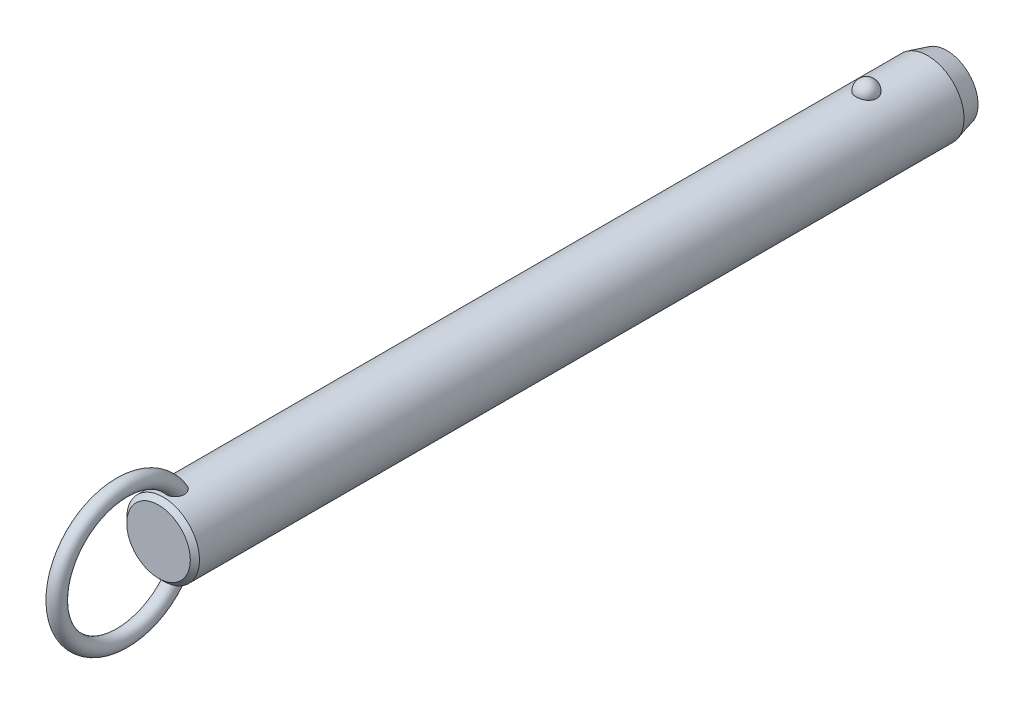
ISO-10303-21;
HEADER;
FILE_DESCRIPTION(('STEP AP214'),'2;1');
FILE_NAME('part.step','',(''),(''),'','','');
FILE_SCHEMA(('AUTOMOTIVE_DESIGN { 1 0 10303 214 1 1 1 1 }'));
ENDSEC;
DATA;
#1=APPLICATION_CONTEXT('core data for automotive mechanical design processes');
#2=APPLICATION_PROTOCOL_DEFINITION('international standard','automotive_design',2000,#1);
#3=PRODUCT_CONTEXT('',#1,'mechanical');
#4=PRODUCT('Part','Part','',(#3));
#5=PRODUCT_RELATED_PRODUCT_CATEGORY('part','',(#4));
#6=PRODUCT_DEFINITION_FORMATION('','',#4);
#7=PRODUCT_DEFINITION_CONTEXT('part definition',#1,'design');
#8=PRODUCT_DEFINITION('design','',#6,#7);
#9=PRODUCT_DEFINITION_SHAPE('','',#8);
#10=(LENGTH_UNIT() NAMED_UNIT(*) SI_UNIT(.MILLI.,.METRE.));
#11=(NAMED_UNIT(*) PLANE_ANGLE_UNIT() SI_UNIT($,.RADIAN.));
#12=(NAMED_UNIT(*) SI_UNIT($,.STERADIAN.) SOLID_ANGLE_UNIT());
#13=UNCERTAINTY_MEASURE_WITH_UNIT(LENGTH_MEASURE(1.E-05),#10,'distance_accuracy_value','');
#14=(GEOMETRIC_REPRESENTATION_CONTEXT(3) GLOBAL_UNCERTAINTY_ASSIGNED_CONTEXT((#13)) GLOBAL_UNIT_ASSIGNED_CONTEXT((#10,
#11,#12)) REPRESENTATION_CONTEXT('',''));
#15=CARTESIAN_POINT('',(0.,0.,0.));
#16=DIRECTION('',(0.,0.,1.));
#17=DIRECTION('',(1.,0.,0.));
#18=AXIS2_PLACEMENT_3D('',#15,#16,#17);
#19=CARTESIAN_POINT('',(0.,0.,172.7));
#20=DIRECTION('',(0.,0.,-1.));
#21=DIRECTION('',(-1.,0.,0.));
#22=AXIS2_PLACEMENT_3D('',#19,#20,#21);
#23=CYLINDRICAL_SURFACE('',#22,9.5);
#24=CARTESIAN_POINT('',(2.67259918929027,9.11631578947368,-2.70000000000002));
#25=CARTESIAN_POINT('',(2.6725968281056,9.11631786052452,-2.54909854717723));
#26=CARTESIAN_POINT('',(2.66030567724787,9.11994722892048,-2.39816735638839));
#27=CARTESIAN_POINT('',(2.6114347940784,9.13405924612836,-2.10058568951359));
#28=CARTESIAN_POINT('',(2.57484658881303,9.14454428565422,-1.95393672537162));
#29=CARTESIAN_POINT('',(2.47830875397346,9.17117631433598,-1.66916069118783));
#30=CARTESIAN_POINT('',(2.41836936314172,9.18732082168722,-1.53102991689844));
#31=CARTESIAN_POINT('',(2.27661331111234,9.22346780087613,-1.26705393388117));
#32=CARTESIAN_POINT('',(2.19479699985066,9.24347021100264,-1.14120852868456));
#33=CARTESIAN_POINT('',(2.01085282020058,9.28522401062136,-0.904632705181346));
#34=CARTESIAN_POINT('',(1.90862396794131,9.30698376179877,-0.793982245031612));
#35=CARTESIAN_POINT('',(1.6867437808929,9.34973971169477,-0.591607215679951));
#36=CARTESIAN_POINT('',(1.56709244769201,9.37073591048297,-0.499882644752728));
#37=CARTESIAN_POINT('',(1.31393976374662,9.40956370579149,-0.338167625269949));
#38=CARTESIAN_POINT('',(1.18048026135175,9.42740444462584,-0.268113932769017));
#39=CARTESIAN_POINT('',(0.903154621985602,9.45799906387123,-0.151390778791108));
#40=CARTESIAN_POINT('',(0.759289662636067,9.47075351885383,-0.104718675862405));
#41=CARTESIAN_POINT('',(0.468074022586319,9.48956256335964,-0.0367633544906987));
#42=CARTESIAN_POINT('',(0.320836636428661,9.49573643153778,-0.015027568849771));
#43=CARTESIAN_POINT('',(0.0246714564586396,9.50112183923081,0.00396199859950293));
#44=CARTESIAN_POINT('',(-0.124256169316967,9.50033406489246,0.00121819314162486));
#45=CARTESIAN_POINT('',(-0.417264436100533,9.4919475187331,-0.0284441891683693));
#46=CARTESIAN_POINT('',(-0.561384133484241,9.48444885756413,-0.0550074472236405));
#47=CARTESIAN_POINT('',(-0.842986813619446,9.46357853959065,-0.131064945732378));
#48=CARTESIAN_POINT('',(-0.98046968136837,9.450206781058,-0.180559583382));
#49=CARTESIAN_POINT('',(-1.24585005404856,9.41890822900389,-0.301476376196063));
#50=CARTESIAN_POINT('',(-1.37368611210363,9.40095498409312,-0.373026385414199));
#51=CARTESIAN_POINT('',(-1.61552738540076,9.3624296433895,-0.536025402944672));
#52=CARTESIAN_POINT('',(-1.72953116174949,9.34185727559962,-0.627476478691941));
#53=CARTESIAN_POINT('',(-1.9429225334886,9.29984568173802,-0.829844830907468));
#54=CARTESIAN_POINT('',(-2.04198021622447,9.27839736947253,-0.941108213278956));
#55=CARTESIAN_POINT('',(-2.2202646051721,9.23735994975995,-1.17883414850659));
#56=CARTESIAN_POINT('',(-2.29948985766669,9.21777097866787,-1.30529781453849));
#57=CARTESIAN_POINT('',(-2.43697287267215,9.18238994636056,-1.57158566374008));
#58=CARTESIAN_POINT('',(-2.49497068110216,9.16664569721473,-1.71155057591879));
#59=CARTESIAN_POINT('',(-2.5872073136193,9.14104303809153,-1.99961197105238));
#60=CARTESIAN_POINT('',(-2.62144683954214,9.13118445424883,-2.1477082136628));
#61=CARTESIAN_POINT('',(-2.66521466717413,9.11850622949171,-2.44715424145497));
#62=CARTESIAN_POINT('',(-2.67484831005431,9.11565658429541,-2.59848735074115));
#63=CARTESIAN_POINT('',(-2.66946735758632,9.11723375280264,-2.90067317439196));
#64=CARTESIAN_POINT('',(-2.65445345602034,9.12166036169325,-3.05152590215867));
#65=CARTESIAN_POINT('',(-2.6002971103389,9.13724422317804,-3.34766110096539));
#66=CARTESIAN_POINT('',(-2.56127978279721,9.14836656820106,-3.49296833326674));
#67=CARTESIAN_POINT('',(-2.46018844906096,9.17606676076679,-3.77477535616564));
#68=CARTESIAN_POINT('',(-2.39811349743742,9.19264483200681,-3.91127478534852));
#69=CARTESIAN_POINT('',(-2.25202303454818,9.22952198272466,-4.17244273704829));
#70=CARTESIAN_POINT('',(-2.16788714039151,9.24984129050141,-4.29704106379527));
#71=CARTESIAN_POINT('',(-1.9799408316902,9.29188255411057,-4.53013066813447));
#72=CARTESIAN_POINT('',(-1.87612963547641,9.31360456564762,-4.63862130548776));
#73=CARTESIAN_POINT('',(-1.65105429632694,9.35612959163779,-4.83690299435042));
#74=CARTESIAN_POINT('',(-1.52972405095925,9.37692871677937,-4.9266199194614));
#75=CARTESIAN_POINT('',(-1.27318250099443,9.41518970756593,-5.08429106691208));
#76=CARTESIAN_POINT('',(-1.13797219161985,9.432651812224,-5.15224684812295));
#77=CARTESIAN_POINT('',(-0.859280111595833,9.46208255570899,-5.26371827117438));
#78=CARTESIAN_POINT('',(-0.715925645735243,9.47411833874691,-5.30753421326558));
#79=CARTESIAN_POINT('',(-0.423550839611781,9.4916822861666,-5.37076321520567));
#80=CARTESIAN_POINT('',(-0.274531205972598,9.49721125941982,-5.39017930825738));
#81=CARTESIAN_POINT('',(0.0218446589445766,9.50110860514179,-5.40390587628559));
#82=CARTESIAN_POINT('',(0.169177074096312,9.49961381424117,-5.39869609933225));
#83=CARTESIAN_POINT('',(0.460808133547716,9.48993906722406,-5.36441955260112));
#84=CARTESIAN_POINT('',(0.605106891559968,9.48175936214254,-5.33535367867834));
#85=CARTESIAN_POINT('',(0.886027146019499,9.4596376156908,-5.25435587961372));
#86=CARTESIAN_POINT('',(1.02267710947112,9.44571881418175,-5.20251612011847));
#87=CARTESIAN_POINT('',(1.28523827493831,9.41358993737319,-5.07741549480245));
#88=CARTESIAN_POINT('',(1.41114877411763,9.39537958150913,-5.00415322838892));
#89=CARTESIAN_POINT('',(1.65085227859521,9.3562644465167,-4.83684599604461));
#90=CARTESIAN_POINT('',(1.76442346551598,9.33532178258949,-4.74249218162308));
#91=CARTESIAN_POINT('',(1.97425672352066,9.29321198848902,-4.53620389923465));
#92=CARTESIAN_POINT('',(2.07051582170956,9.27204482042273,-4.42426641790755));
#93=CARTESIAN_POINT('',(2.24490086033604,9.23139221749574,-4.18363183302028));
#94=CARTESIAN_POINT('',(2.32267019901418,9.21194380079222,-4.05466990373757));
#95=CARTESIAN_POINT('',(2.45584092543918,9.1773419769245,-3.78517836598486));
#96=CARTESIAN_POINT('',(2.51124979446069,9.16218713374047,-3.644652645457));
#97=CARTESIAN_POINT('',(2.59380876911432,9.13913522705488,-3.37104301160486));
#98=CARTESIAN_POINT('',(2.62330266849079,9.13064624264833,-3.23871053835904));
#99=CARTESIAN_POINT('',(2.66269870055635,9.11923566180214,-2.97092664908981));
#100=CARTESIAN_POINT('',(2.67260130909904,9.11631393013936,-2.83547530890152));
#101=CARTESIAN_POINT('',(2.67259918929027,9.11631578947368,-2.70000000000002));
#102=B_SPLINE_CURVE_WITH_KNOTS('',3,(#24,#25,#26,#27,#28,#29,#30,#31,#32,#33,#34,#35,#36,#37,
#38,#39,#40,#41,#42,#43,#44,#45,#46,#47,#48,#49,#50,#51,#52,#53,#54,#55,#56,#57,#58,#59,#60,#61,
#62,#63,#64,#65,#66,#67,#68,#69,#70,#71,#72,#73,#74,#75,#76,#77,#78,#79,#80,#81,#82,#83,#84,#85,
#86,#87,#88,#89,#90,#91,#92,#93,#94,#95,#96,#97,#98,#99,#100,#101),.UNSPECIFIED.,.T.,.F.,(4,2,2,
2,2,2,2,2,2,2,2,2,2,2,2,2,2,2,2,2,2,2,2,2,2,2,2,2,2,2,2,2,2,2,2,2,2,2,4),(0.,0.452217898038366,
0.904593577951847,1.35677112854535,1.80894144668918,2.26340676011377,2.71787203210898,
3.17099820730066,3.62407318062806,4.0687883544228,4.51345969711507,4.95160616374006,
5.38976021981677,5.83050358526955,6.27129275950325,6.72071308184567,7.17016633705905,
7.62495278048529,8.07972578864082,8.53254856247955,8.98535859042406,9.43582813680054,
9.88631615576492,10.3393155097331,10.7923328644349,11.2471065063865,11.7018475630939,
12.1507959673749,12.5996885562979,13.0398725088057,13.4800399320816,13.9184421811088,
14.3568730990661,14.802202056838,15.2476074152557,15.7010097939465,16.1542603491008,
16.5602594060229,16.9662486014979),.UNSPECIFIED.);
#103=CARTESIAN_POINT('',(2.67259918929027,9.11631578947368,-2.70000000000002));
#104=VERTEX_POINT('',#103);
#105=EDGE_CURVE('E41',#104,#104,#102,.T.);
#106=ORIENTED_EDGE('',*,*,#105,.T.);
#107=EDGE_LOOP('',(#106));
#108=FACE_BOUND('',#107,.T.);
#109=CARTESIAN_POINT('',(0.,0.,181.02));
#110=DIRECTION('',(0.,0.,1.));
#111=DIRECTION('',(1.,0.,0.));
#112=AXIS2_PLACEMENT_3D('',#109,#110,#111);
#113=CIRCLE('',#112,9.5);
#114=CARTESIAN_POINT('',(9.5,0.,181.02));
#115=VERTEX_POINT('',#114);
#116=EDGE_CURVE('E10',#115,#115,#113,.F.);
#117=ORIENTED_EDGE('',*,*,#116,.T.);
#118=EDGE_LOOP('',(#117));
#119=FACE_BOUND('',#118,.T.);
#120=CARTESIAN_POINT('',(-0.697062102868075,-9.47439269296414,175.367808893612));
#121=CARTESIAN_POINT('',(-0.799579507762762,-9.46685146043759,175.407482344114));
#122=CARTESIAN_POINT('',(-0.89857563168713,-9.45788043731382,175.4559309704));
#123=CARTESIAN_POINT('',(-1.08670047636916,-9.43811593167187,175.568868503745));
#124=CARTESIAN_POINT('',(-1.17583204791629,-9.42732297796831,175.633352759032));
#125=CARTESIAN_POINT('',(-1.34179806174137,-9.40513672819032,175.776209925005));
#126=CARTESIAN_POINT('',(-1.41865133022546,-9.39374438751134,175.854561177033));
#127=CARTESIAN_POINT('',(-1.5586004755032,-9.37154196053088,176.022752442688));
#128=CARTESIAN_POINT('',(-1.62169476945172,-9.3607319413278,176.11259377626));
#129=CARTESIAN_POINT('',(-1.73527695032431,-9.34035749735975,176.304500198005));
#130=CARTESIAN_POINT('',(-1.78522266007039,-9.33085270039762,176.406891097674));
#131=CARTESIAN_POINT('',(-1.86924997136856,-9.3143834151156,176.618148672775));
#132=CARTESIAN_POINT('',(-1.90332570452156,-9.30741986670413,176.727017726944));
#133=CARTESIAN_POINT('',(-1.95893603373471,-9.29588482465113,176.960473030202));
#134=CARTESIAN_POINT('',(-1.97872420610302,-9.29165182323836,177.085489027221));
#135=CARTESIAN_POINT('',(-2.00062129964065,-9.28695978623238,177.337080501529));
#136=CARTESIAN_POINT('',(-2.00272284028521,-9.28650232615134,177.463656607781));
#137=CARTESIAN_POINT('',(-1.98958876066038,-9.28932750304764,177.736815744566));
#138=CARTESIAN_POINT('',(-1.97143366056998,-9.2932400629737,177.883251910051));
#139=CARTESIAN_POINT('',(-1.91479925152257,-9.30507151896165,178.172062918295));
#140=CARTESIAN_POINT('',(-1.87629122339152,-9.31299607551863,178.314431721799));
#141=CARTESIAN_POINT('',(-1.7722568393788,-9.33340232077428,178.615172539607));
#142=CARTESIAN_POINT('',(-1.70334898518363,-9.34641636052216,178.772369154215));
#143=CARTESIAN_POINT('',(-1.58111062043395,-9.36759153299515,178.997517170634));
#144=CARTESIAN_POINT('',(-1.53721459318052,-9.3749261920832,179.070796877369));
#145=CARTESIAN_POINT('',(-1.44302631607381,-9.38988566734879,179.21307405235));
#146=CARTESIAN_POINT('',(-1.39273721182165,-9.39751033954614,179.282073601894));
#147=CARTESIAN_POINT('',(-1.26775962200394,-9.41530678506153,179.436983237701));
#148=CARTESIAN_POINT('',(-1.19052326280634,-9.42548108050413,179.520871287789));
#149=CARTESIAN_POINT('',(-1.0242024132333,-9.44499825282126,179.676008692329));
#150=CARTESIAN_POINT('',(-0.935139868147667,-9.45434261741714,179.747280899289));
#151=CARTESIAN_POINT('',(-0.766610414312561,-9.46930670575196,179.858695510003));
#152=CARTESIAN_POINT('',(-0.689439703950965,-9.47529223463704,179.902235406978));
#153=CARTESIAN_POINT('',(-0.52894200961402,-9.48560294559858,179.97631336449));
#154=CARTESIAN_POINT('',(-0.445620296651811,-9.48992953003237,180.006862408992));
#155=CARTESIAN_POINT('',(-0.273901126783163,-9.49644161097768,180.052579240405));
#156=CARTESIAN_POINT('',(-0.18546574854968,-9.49860811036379,180.06761059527));
#157=CARTESIAN_POINT('',(-0.00734541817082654,-9.5004135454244,180.080149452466));
#158=CARTESIAN_POINT('',(0.082338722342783,-9.50005405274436,180.077667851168));
#159=CARTESIAN_POINT('',(0.247679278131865,-9.49708301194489,180.056995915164));
#160=CARTESIAN_POINT('',(0.323620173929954,-9.49477609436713,180.040930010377));
#161=CARTESIAN_POINT('',(0.471981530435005,-9.48855917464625,179.997172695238));
#162=CARTESIAN_POINT('',(0.544400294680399,-9.48464840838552,179.969475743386));
#163=CARTESIAN_POINT('',(0.708947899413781,-9.47398336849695,179.89280266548));
#164=CARTESIAN_POINT('',(0.799149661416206,-9.46671310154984,179.839774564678));
#165=CARTESIAN_POINT('',(0.969783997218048,-9.45076225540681,179.719973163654));
#166=CARTESIAN_POINT('',(1.05019415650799,-9.44207854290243,179.653169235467));
#167=CARTESIAN_POINT('',(1.23092343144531,-9.42051459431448,179.480759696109));
#168=CARTESIAN_POINT('',(1.32652499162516,-9.40733378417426,179.37026193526));
#169=CARTESIAN_POINT('',(1.49893121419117,-9.38140745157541,179.135561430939));
#170=CARTESIAN_POINT('',(1.57571616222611,-9.36866239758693,179.011344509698));
#171=CARTESIAN_POINT('',(1.71285426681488,-9.34457644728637,178.749389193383));
#172=CARTESIAN_POINT('',(1.77266365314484,-9.33328726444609,178.61136233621));
#173=CARTESIAN_POINT('',(1.87239208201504,-9.31379209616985,178.328051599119));
#174=CARTESIAN_POINT('',(1.91230158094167,-9.30558759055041,178.182764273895));
#175=CARTESIAN_POINT('',(1.97604189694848,-9.29228394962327,177.862028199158));
#176=CARTESIAN_POINT('',(1.9958743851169,-9.28797202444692,177.685724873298));
#177=CARTESIAN_POINT('',(2.00295708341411,-9.28645519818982,177.332414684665));
#178=CARTESIAN_POINT('',(1.99025930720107,-9.28923895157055,177.155409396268));
#179=CARTESIAN_POINT('',(1.93735479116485,-9.30038134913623,176.856338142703));
#180=CARTESIAN_POINT('',(1.90576827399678,-9.30697680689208,176.732667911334));
#181=CARTESIAN_POINT('',(1.82287484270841,-9.32356855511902,176.492329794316));
#182=CARTESIAN_POINT('',(1.77158213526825,-9.33356239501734,176.375656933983));
#183=CARTESIAN_POINT('',(1.64885744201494,-9.35602275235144,176.152706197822));
#184=CARTESIAN_POINT('',(1.57730995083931,-9.36850332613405,176.046492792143));
#185=CARTESIAN_POINT('',(1.41543264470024,-9.39431873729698,175.849553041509));
#186=CARTESIAN_POINT('',(1.32510883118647,-9.40765330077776,175.758821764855));
#187=CARTESIAN_POINT('',(1.13846223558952,-9.43195720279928,175.605033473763));
#188=CARTESIAN_POINT('',(1.04369890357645,-9.44302894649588,175.540094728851));
#189=CARTESIAN_POINT('',(0.843965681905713,-9.46296805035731,175.428038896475));
#190=CARTESIAN_POINT('',(0.739000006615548,-9.47183631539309,175.380914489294));
#191=CARTESIAN_POINT('',(0.528175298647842,-9.48586140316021,175.308117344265));
#192=CARTESIAN_POINT('',(0.422686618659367,-9.49119633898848,175.28140249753));
#193=CARTESIAN_POINT('',(0.208590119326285,-9.49831365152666,175.246013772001));
#194=CARTESIAN_POINT('',(0.0999817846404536,-9.500095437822,175.237342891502));
#195=CARTESIAN_POINT('',(-0.126104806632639,-9.49988861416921,175.238350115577));
#196=CARTESIAN_POINT('',(-0.243578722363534,-9.49757821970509,175.249594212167));
#197=CARTESIAN_POINT('',(-0.474390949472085,-9.48885165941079,175.293167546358));
#198=CARTESIAN_POINT('',(-0.587729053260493,-9.48243528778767,175.325497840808));
#199=CARTESIAN_POINT('',(-0.697062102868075,-9.47439269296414,175.367808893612));
#200=B_SPLINE_CURVE_WITH_KNOTS('',3,(#120,#121,#122,#123,#124,#125,#126,#127,#128,#129,#130,
#131,#132,#133,#134,#135,#136,#137,#138,#139,#140,#141,#142,#143,#144,#145,#146,#147,#148,#149,
#150,#151,#152,#153,#154,#155,#156,#157,#158,#159,#160,#161,#162,#163,#164,#165,#166,#167,#168,
#169,#170,#171,#172,#173,#174,#175,#176,#177,#178,#179,#180,#181,#182,#183,#184,#185,#186,#187,
#188,#189,#190,#191,#192,#193,#194,#195,#196,#197,#198,#199),.UNSPECIFIED.,.T.,.F.,(4,2,2,2,2,2,
2,2,2,2,2,2,2,2,2,2,2,2,2,2,2,2,2,2,2,2,2,2,2,2,2,2,2,2,2,2,2,2,2,4),(0.,0.330119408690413,
0.6601431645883,0.98965593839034,1.31920659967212,1.66074728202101,2.00241415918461,
2.3808869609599,2.75951768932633,3.20065679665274,3.64242004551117,4.15620996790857,
4.4131416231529,4.66994734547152,5.01228664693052,5.35399933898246,5.61943037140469,
5.88463652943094,6.15215502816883,6.41950709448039,6.65144391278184,6.88349136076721,
7.19641200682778,7.51003602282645,7.94779711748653,8.3860149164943,8.83699707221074,
9.28819530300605,9.81778662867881,10.34653170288,10.7284172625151,11.1100280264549,
11.4938603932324,11.8775702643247,12.2220189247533,12.5663259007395,12.8915939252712,
13.2169159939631,13.5689650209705,13.9210316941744),.UNSPECIFIED.);
#201=CARTESIAN_POINT('',(-0.697062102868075,-9.47439269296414,175.367808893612));
#202=VERTEX_POINT('',#201);
#203=EDGE_CURVE('E59',#202,#202,#200,.T.);
#204=ORIENTED_EDGE('',*,*,#203,.T.);
#205=EDGE_LOOP('',(#204));
#206=FACE_BOUND('',#205,.T.);
#207=CARTESIAN_POINT('',(-0.697062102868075,9.47439269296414,175.367808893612));
#208=CARTESIAN_POINT('',(-0.597792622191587,9.48169483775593,175.32939564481));
#209=CARTESIAN_POINT('',(-0.495106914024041,9.48766580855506,175.299168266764));
#210=CARTESIAN_POINT('',(-0.285876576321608,9.49627648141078,175.256032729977));
#211=CARTESIAN_POINT('',(-0.179324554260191,9.49890941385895,175.243159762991));
#212=CARTESIAN_POINT('',(0.0344157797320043,9.50053798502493,175.235166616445));
#213=CARTESIAN_POINT('',(0.14160360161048,9.49953613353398,175.240034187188));
#214=CARTESIAN_POINT('',(0.353563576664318,9.49401038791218,175.267365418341));
#215=CARTESIAN_POINT('',(0.458336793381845,9.48948807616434,175.28982117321));
#216=CARTESIAN_POINT('',(0.662493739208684,9.4774236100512,175.351671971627));
#217=CARTESIAN_POINT('',(0.761881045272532,9.46988348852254,175.391055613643));
#218=CARTESIAN_POINT('',(0.952608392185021,9.45260382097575,175.485634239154));
#219=CARTESIAN_POINT('',(1.04394806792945,9.44286417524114,175.540829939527));
#220=CARTESIAN_POINT('',(1.21712767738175,9.42211760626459,175.666066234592));
#221=CARTESIAN_POINT('',(1.29885671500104,9.41109835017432,175.736257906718));
#222=CARTESIAN_POINT('',(1.44978975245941,9.38903310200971,175.888980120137));
#223=CARTESIAN_POINT('',(1.51899278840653,9.37798710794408,175.971511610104));
#224=CARTESIAN_POINT('',(1.64602857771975,9.35654375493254,176.149776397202));
#225=CARTESIAN_POINT('',(1.70333052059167,9.34618688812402,176.245891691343));
#226=CARTESIAN_POINT('',(1.80259341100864,9.32755128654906,176.445897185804));
#227=CARTESIAN_POINT('',(1.84454942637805,9.31927322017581,176.549789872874));
#228=CARTESIAN_POINT('',(1.91637039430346,9.30478365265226,176.772213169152));
#229=CARTESIAN_POINT('',(1.944805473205,9.29882552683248,176.891219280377));
#230=CARTESIAN_POINT('',(1.98449865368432,9.29043398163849,177.132143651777));
#231=CARTESIAN_POINT('',(1.99574908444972,9.28800213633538,177.254063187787));
#232=CARTESIAN_POINT('',(2.00275141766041,9.28649645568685,177.516932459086));
#233=CARTESIAN_POINT('',(1.99588238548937,9.28799035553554,177.657952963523));
#234=CARTESIAN_POINT('',(1.96270559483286,9.29505517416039,177.937621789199));
#235=CARTESIAN_POINT('',(1.93637872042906,9.30063010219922,178.076267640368));
#236=CARTESIAN_POINT('',(1.85949176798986,9.31633564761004,178.372561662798));
#237=CARTESIAN_POINT('',(1.80549792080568,9.3270926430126,178.529290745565));
#238=CARTESIAN_POINT('',(1.67376869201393,9.3516306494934,178.832284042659));
#239=CARTESIAN_POINT('',(1.59603181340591,9.36541185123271,178.978547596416));
#240=CARTESIAN_POINT('',(1.4360277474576,9.39110706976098,179.225813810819));
#241=CARTESIAN_POINT('',(1.35831795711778,9.40278656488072,179.329791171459));
#242=CARTESIAN_POINT('',(1.18774483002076,9.42585025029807,179.524534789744));
#243=CARTESIAN_POINT('',(1.09490932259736,9.43723493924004,179.615324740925));
#244=CARTESIAN_POINT('',(0.921110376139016,9.45552616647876,179.75620334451));
#245=CARTESIAN_POINT('',(0.843738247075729,9.46281058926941,179.810656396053));
#246=CARTESIAN_POINT('',(0.681245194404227,9.47589120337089,179.906711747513));
#247=CARTESIAN_POINT('',(0.596135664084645,9.48168953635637,179.948332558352));
#248=CARTESIAN_POINT('',(0.433779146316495,9.49038144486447,180.010089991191));
#249=CARTESIAN_POINT('',(0.35745955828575,9.49359170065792,180.03260136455));
#250=CARTESIAN_POINT('',(0.202074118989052,9.49816761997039,180.064574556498));
#251=CARTESIAN_POINT('',(0.123010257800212,9.49953459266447,180.074045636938));
#252=CARTESIAN_POINT('',(-0.0357372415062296,9.50026497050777,180.079114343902));
#253=CARTESIAN_POINT('',(-0.115421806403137,9.49962433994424,180.074684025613));
#254=CARTESIAN_POINT('',(-0.272823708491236,9.49640854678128,180.052296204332));
#255=CARTESIAN_POINT('',(-0.350540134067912,9.4938325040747,180.034332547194));
#256=CARTESIAN_POINT('',(-0.500580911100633,9.48709462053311,179.986802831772));
#257=CARTESIAN_POINT('',(-0.572979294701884,9.48296359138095,179.957461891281));
#258=CARTESIAN_POINT('',(-0.712864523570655,9.47347609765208,179.889008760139));
#259=CARTESIAN_POINT('',(-0.780349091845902,9.46811906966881,179.849892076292));
#260=CARTESIAN_POINT('',(-0.946309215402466,9.45329720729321,179.739432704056));
#261=CARTESIAN_POINT('',(-1.04090230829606,9.44321512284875,179.662329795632));
#262=CARTESIAN_POINT('',(-1.21661929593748,9.42219227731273,179.49409718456));
#263=CARTESIAN_POINT('',(-1.29770519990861,9.41124921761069,179.402929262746));
#264=CARTESIAN_POINT('',(-1.47319646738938,9.38563439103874,179.176162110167));
#265=CARTESIAN_POINT('',(-1.5620887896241,9.37102009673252,179.036289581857));
#266=CARTESIAN_POINT('',(-1.71623987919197,9.34401559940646,178.743950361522));
#267=CARTESIAN_POINT('',(-1.7814786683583,9.33162728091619,178.591473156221));
#268=CARTESIAN_POINT('',(-1.88853837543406,9.31055541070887,178.275647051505));
#269=CARTESIAN_POINT('',(-1.92998995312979,9.30193076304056,178.112168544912));
#270=CARTESIAN_POINT('',(-1.98590726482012,9.29015757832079,177.780526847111));
#271=CARTESIAN_POINT('',(-2.0004070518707,9.2870021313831,177.612369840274));
#272=CARTESIAN_POINT('',(-1.99964701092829,9.28716218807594,177.305080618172));
#273=CARTESIAN_POINT('',(-1.98908145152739,9.28945704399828,177.165936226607));
#274=CARTESIAN_POINT('',(-1.94566294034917,9.29865169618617,176.891153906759));
#275=CARTESIAN_POINT('',(-1.91282062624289,9.30554929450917,176.755514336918));
#276=CARTESIAN_POINT('',(-1.84582133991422,9.31898248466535,176.557802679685));
#277=CARTESIAN_POINT('',(-1.82038084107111,9.32400364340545,176.492583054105));
#278=CARTESIAN_POINT('',(-1.7635051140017,9.33492884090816,176.364903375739));
#279=CARTESIAN_POINT('',(-1.73207305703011,9.34083241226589,176.302441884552));
#280=CARTESIAN_POINT('',(-1.66324243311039,9.35333332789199,176.18094078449));
#281=CARTESIAN_POINT('',(-1.625842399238,9.35993084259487,176.121902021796));
#282=CARTESIAN_POINT('',(-1.54527678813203,9.37356864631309,176.007987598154));
#283=CARTESIAN_POINT('',(-1.50211241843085,9.38060884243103,175.953111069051));
#284=CARTESIAN_POINT('',(-1.37681147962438,9.40004442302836,175.809961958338));
#285=CARTESIAN_POINT('',(-1.28916358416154,9.41261047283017,175.726429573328));
#286=CARTESIAN_POINT('',(-1.09996826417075,9.43658180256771,175.577236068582));
#287=CARTESIAN_POINT('',(-0.998461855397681,9.44799034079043,175.511523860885));
#288=CARTESIAN_POINT('',(-0.860188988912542,9.46103017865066,175.4394367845));
#289=CARTESIAN_POINT('',(-0.828141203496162,9.46389141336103,175.423851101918));
#290=CARTESIAN_POINT('',(-0.763210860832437,9.46934915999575,175.394473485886));
#291=CARTESIAN_POINT('',(-0.730328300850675,9.47194567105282,175.380681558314));
#292=CARTESIAN_POINT('',(-0.697062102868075,9.47439269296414,175.367808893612));
#293=B_SPLINE_CURVE_WITH_KNOTS('',3,(#207,#208,#209,#210,#211,#212,#213,#214,#215,#216,#217,
#218,#219,#220,#221,#222,#223,#224,#225,#226,#227,#228,#229,#230,#231,#232,#233,#234,#235,#236,
#237,#238,#239,#240,#241,#242,#243,#244,#245,#246,#247,#248,#249,#250,#251,#252,#253,#254,#255,
#256,#257,#258,#259,#260,#261,#262,#263,#264,#265,#266,#267,#268,#269,#270,#271,#272,#273,#274,
#275,#276,#277,#278,#279,#280,#281,#282,#283,#284,#285,#286,#287,#288,#289,#290,#291,#292),
.UNSPECIFIED.,.T.,.F.,(4,2,2,2,2,2,2,2,2,2,2,2,2,2,2,2,2,2,2,2,2,2,2,2,2,2,2,2,2,2,2,2,2,2,2,2,
2,2,2,2,2,2,4),(0.,0.319942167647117,0.640532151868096,0.960900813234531,1.28112555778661,
1.60113495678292,1.92115886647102,2.24457323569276,2.56801248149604,2.90371927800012,
3.23953387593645,3.60560313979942,3.97183576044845,4.39383693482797,4.81625324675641,
5.31257045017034,5.80891895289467,6.19868344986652,6.58773876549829,6.87145417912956,
7.15475838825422,7.39263751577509,7.63034760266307,7.86853584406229,8.10683246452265,
8.34063661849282,8.57454843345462,8.93983939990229,9.30614105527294,9.80266668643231,
10.2996107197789,10.8040753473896,11.3079021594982,11.7249776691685,12.1418541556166,
12.3521485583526,12.5623319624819,12.7725671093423,12.9827582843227,13.345827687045,
13.7078449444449,13.8150604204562,13.9222762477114),.UNSPECIFIED.);
#294=CARTESIAN_POINT('',(-0.697062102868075,9.47439269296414,175.367808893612));
#295=VERTEX_POINT('',#294);
#296=EDGE_CURVE('E67',#295,#295,#293,.T.);
#297=ORIENTED_EDGE('',*,*,#296,.T.);
#298=EDGE_LOOP('',(#297));
#299=FACE_BOUND('',#298,.T.);
#300=CARTESIAN_POINT('',(0.,0.,-18.6999999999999));
#301=DIRECTION('',(0.,0.,-1.));
#302=DIRECTION('',(-1.,0.,0.));
#303=AXIS2_PLACEMENT_3D('',#300,#301,#302);
#304=CIRCLE('',#303,9.5);
#305=CARTESIAN_POINT('',(-9.5,0.,-18.6999999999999));
#306=VERTEX_POINT('',#305);
#307=EDGE_CURVE('E56',#306,#306,#304,.F.);
#308=ORIENTED_EDGE('',*,*,#307,.T.);
#309=EDGE_LOOP('',(#308));
#310=FACE_BOUND('',#309,.T.);
#311=ADVANCED_FACE('F37',(#108,#119,#206,#299,#310),#23,.T.);
#312=CARTESIAN_POINT('',(0.,0.,-23.7));
#313=DIRECTION('',(0.,0.,-1.));
#314=DIRECTION('',(-1.,0.,0.));
#315=AXIS2_PLACEMENT_3D('',#312,#313,#314);
#316=PLANE('',#315);
#317=CARTESIAN_POINT('',(0.,0.,-23.7));
#318=DIRECTION('',(0.,0.,-1.));
#319=DIRECTION('',(-1.,0.,0.));
#320=AXIS2_PLACEMENT_3D('',#317,#318,#319);
#321=CIRCLE('',#320,8.16025403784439);
#322=CARTESIAN_POINT('',(-8.16025403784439,0.,-23.7));
#323=VERTEX_POINT('',#322);
#324=EDGE_CURVE('E66',#323,#323,#321,.T.);
#325=ORIENTED_EDGE('',*,*,#324,.T.);
#326=EDGE_LOOP('',(#325));
#327=FACE_BOUND('',#326,.T.);
#328=ADVANCED_FACE('F85',(#327),#316,.T.);
#329=CARTESIAN_POINT('',(0.,0.,-23.7));
#330=DIRECTION('',(0.,0.,1.));
#331=DIRECTION('',(1.,0.,0.));
#332=AXIS2_PLACEMENT_3D('',#329,#330,#331);
#333=CONICAL_SURFACE('',#332,8.16025403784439,0.261799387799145);
#334=ORIENTED_EDGE('',*,*,#307,.F.);
#335=EDGE_LOOP('',(#334));
#336=FACE_BOUND('',#335,.T.);
#337=ORIENTED_EDGE('',*,*,#324,.F.);
#338=EDGE_LOOP('',(#337));
#339=FACE_BOUND('',#338,.T.);
#340=ADVANCED_FACE('F83',(#336,#339),#333,.T.);
#341=CARTESIAN_POINT('',(0.,0.,182.22));
#342=DIRECTION('',(0.,0.,1.));
#343=DIRECTION('',(1.,0.,0.));
#344=AXIS2_PLACEMENT_3D('',#341,#342,#343);
#345=PLANE('',#344);
#346=CARTESIAN_POINT('',(0.,0.,182.22));
#347=DIRECTION('',(0.,0.,1.));
#348=DIRECTION('',(1.,0.,0.));
#349=AXIS2_PLACEMENT_3D('',#346,#347,#348);
#350=CIRCLE('',#349,8.30000000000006);
#351=CARTESIAN_POINT('',(8.30000000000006,0.,182.22));
#352=VERTEX_POINT('',#351);
#353=EDGE_CURVE('E50',#352,#352,#350,.T.);
#354=ORIENTED_EDGE('',*,*,#353,.T.);
#355=EDGE_LOOP('',(#354));
#356=FACE_BOUND('',#355,.T.);
#357=ADVANCED_FACE('F77',(#356),#345,.T.);
#358=CARTESIAN_POINT('',(0.,0.,191.75));
#359=DIRECTION('',(1.,0.,0.));
#360=DIRECTION('',(0.,0.,-1.));
#361=AXIS2_PLACEMENT_3D('',#358,#359,#360);
#362=TOROIDAL_SURFACE('',#361,17.05,2.);
#363=ORIENTED_EDGE('',*,*,#296,.F.);
#364=EDGE_LOOP('',(#363));
#365=FACE_BOUND('',#364,.T.);
#366=ORIENTED_EDGE('',*,*,#203,.F.);
#367=EDGE_LOOP('',(#366));
#368=FACE_BOUND('',#367,.T.);
#369=ADVANCED_FACE('F73',(#365,#368),#362,.T.);
#370=CARTESIAN_POINT('',(0.,0.,182.22));
#371=DIRECTION('',(0.,0.,-1.));
#372=DIRECTION('',(-1.,0.,0.));
#373=AXIS2_PLACEMENT_3D('',#370,#371,#372);
#374=CONICAL_SURFACE('',#373,8.30000000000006,0.785398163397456);
#375=ORIENTED_EDGE('',*,*,#116,.F.);
#376=EDGE_LOOP('',(#375));
#377=FACE_BOUND('',#376,.T.);
#378=ORIENTED_EDGE('',*,*,#353,.F.);
#379=EDGE_LOOP('',(#378));
#380=FACE_BOUND('',#379,.T.);
#381=ADVANCED_FACE('F39',(#377,#380),#374,.T.);
#382=CARTESIAN_POINT('',(0.,9.5,-2.70000000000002));
#383=DIRECTION('',(0.,1.,0.));
#384=DIRECTION('',(0.,0.,-1.));
#385=AXIS2_PLACEMENT_3D('',#382,#383,#384);
#386=SPHERICAL_SURFACE('',#385,2.7);
#387=ORIENTED_EDGE('',*,*,#105,.F.);
#388=EDGE_LOOP('',(#387));
#389=FACE_BOUND('',#388,.T.);
#390=ADVANCED_FACE('F79',(#389),#386,.T.);
#391=CLOSED_SHELL('',(#311,#328,#340,#357,#369,#381,#390));
#392=MANIFOLD_SOLID_BREP('B2',#391);
#393=ADVANCED_BREP_SHAPE_REPRESENTATION('',(#18,#392),#14);
#394=SHAPE_DEFINITION_REPRESENTATION(#9,#393);
ENDSEC;
END-ISO-10303-21;
